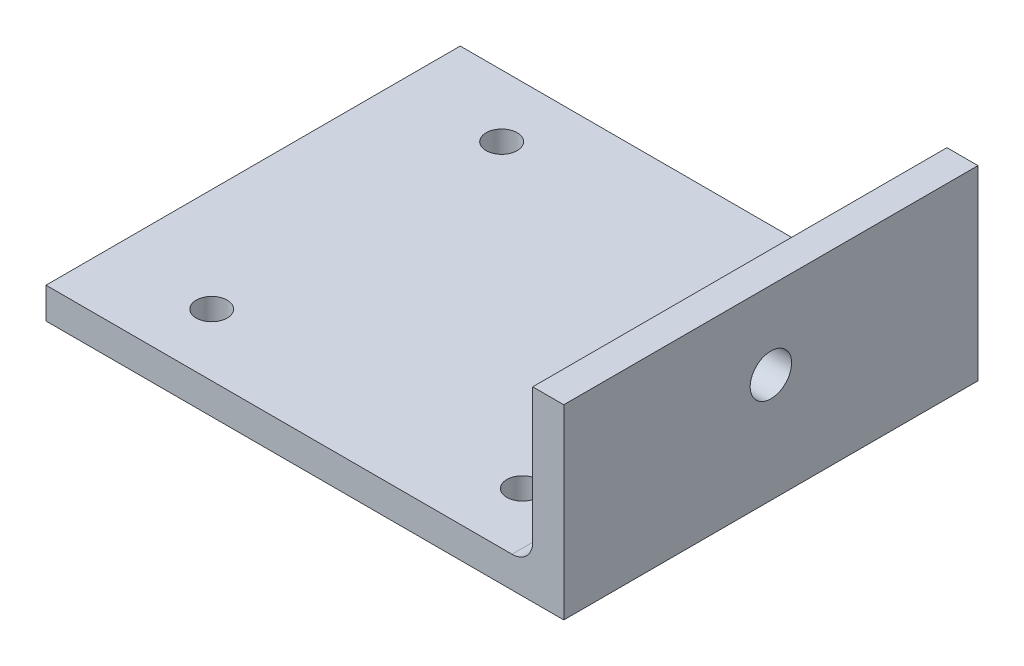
ISO-10303-21;
HEADER;
FILE_DESCRIPTION(('STEP AP214'),'2;1');
FILE_NAME('part.step','',(''),(''),'','','');
FILE_SCHEMA(('AUTOMOTIVE_DESIGN { 1 0 10303 214 1 1 1 1 }'));
ENDSEC;
DATA;
#1=APPLICATION_CONTEXT('core data for automotive mechanical design processes');
#2=APPLICATION_PROTOCOL_DEFINITION('international standard','automotive_design',2000,#1);
#3=PRODUCT_CONTEXT('',#1,'mechanical');
#4=PRODUCT('Part','Part','',(#3));
#5=PRODUCT_RELATED_PRODUCT_CATEGORY('part','',(#4));
#6=PRODUCT_DEFINITION_FORMATION('','',#4);
#7=PRODUCT_DEFINITION_CONTEXT('part definition',#1,'design');
#8=PRODUCT_DEFINITION('design','',#6,#7);
#9=PRODUCT_DEFINITION_SHAPE('','',#8);
#10=(LENGTH_UNIT() NAMED_UNIT(*) SI_UNIT(.MILLI.,.METRE.));
#11=(NAMED_UNIT(*) PLANE_ANGLE_UNIT() SI_UNIT($,.RADIAN.));
#12=(NAMED_UNIT(*) SI_UNIT($,.STERADIAN.) SOLID_ANGLE_UNIT());
#13=UNCERTAINTY_MEASURE_WITH_UNIT(LENGTH_MEASURE(1.E-05),#10,'distance_accuracy_value','');
#14=(GEOMETRIC_REPRESENTATION_CONTEXT(3) GLOBAL_UNCERTAINTY_ASSIGNED_CONTEXT((#13)) GLOBAL_UNIT_ASSIGNED_CONTEXT((#10,
#11,#12)) REPRESENTATION_CONTEXT('',''));
#15=CARTESIAN_POINT('',(0.,0.,0.));
#16=DIRECTION('',(0.,0.,1.));
#17=DIRECTION('',(1.,0.,0.));
#18=AXIS2_PLACEMENT_3D('',#15,#16,#17);
#19=CARTESIAN_POINT('',(0.,3.,0.));
#20=DIRECTION('',(0.,1.,0.));
#21=DIRECTION('',(0.,0.,1.));
#22=AXIS2_PLACEMENT_3D('',#19,#20,#21);
#23=PLANE('',#22);
#24=DIRECTION('',(1.,0.,0.));
#25=VECTOR('',#24,1.);
#26=CARTESIAN_POINT('',(-21.4432989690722,3.,22.0618556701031));
#27=LINE('',#26,#25);
#28=CARTESIAN_POINT('',(-21.4432989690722,3.,22.0618556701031));
#29=VERTEX_POINT('',#28);
#30=CARTESIAN_POINT('',(23.5567010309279,3.,22.0618556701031));
#31=VERTEX_POINT('',#30);
#32=EDGE_CURVE('E156',#29,#31,#27,.T.);
#33=ORIENTED_EDGE('',*,*,#32,.T.);
#34=DIRECTION('',(0.,0.,1.));
#35=VECTOR('',#34,1.);
#36=CARTESIAN_POINT('',(23.5567010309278,3.,0.));
#37=LINE('',#36,#35);
#38=CARTESIAN_POINT('',(23.5567010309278,3.,-17.9381443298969));
#39=VERTEX_POINT('',#38);
#40=EDGE_CURVE('E54',#31,#39,#37,.F.);
#41=ORIENTED_EDGE('',*,*,#40,.T.);
#42=DIRECTION('',(-1.,0.,0.));
#43=VECTOR('',#42,1.);
#44=CARTESIAN_POINT('',(-21.4432989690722,3.,-17.9381443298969));
#45=LINE('',#44,#43);
#46=CARTESIAN_POINT('',(-21.4432989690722,3.,-17.9381443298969));
#47=VERTEX_POINT('',#46);
#48=EDGE_CURVE('E159',#39,#47,#45,.T.);
#49=ORIENTED_EDGE('',*,*,#48,.T.);
#50=DIRECTION('',(0.,0.,1.));
#51=VECTOR('',#50,1.);
#52=CARTESIAN_POINT('',(-21.4432989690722,3.,-17.9381443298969));
#53=LINE('',#52,#51);
#54=EDGE_CURVE('E153',#47,#29,#53,.T.);
#55=ORIENTED_EDGE('',*,*,#54,.T.);
#56=EDGE_LOOP('',(#33,#41,#49,#55));
#57=FACE_BOUND('',#56,.T.);
#58=CARTESIAN_POINT('',(18.5567010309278,3.,-11.9381443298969));
#59=DIRECTION('',(0.,1.,0.));
#60=DIRECTION('',(0.,0.,1.));
#61=AXIS2_PLACEMENT_3D('',#58,#59,#60);
#62=CIRCLE('',#61,1.5);
#63=CARTESIAN_POINT('',(18.5567010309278,3.,-10.4381443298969));
#64=VERTEX_POINT('',#63);
#65=EDGE_CURVE('E135',#64,#64,#62,.T.);
#66=ORIENTED_EDGE('',*,*,#65,.F.);
#67=EDGE_LOOP('',(#66));
#68=FACE_BOUND('',#67,.T.);
#69=CARTESIAN_POINT('',(-11.4432989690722,3.,16.0618556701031));
#70=DIRECTION('',(0.,1.,0.));
#71=DIRECTION('',(0.,0.,1.));
#72=AXIS2_PLACEMENT_3D('',#69,#70,#71);
#73=CIRCLE('',#72,1.5);
#74=CARTESIAN_POINT('',(-11.4432989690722,3.,17.5618556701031));
#75=VERTEX_POINT('',#74);
#76=EDGE_CURVE('E147',#75,#75,#73,.T.);
#77=ORIENTED_EDGE('',*,*,#76,.F.);
#78=EDGE_LOOP('',(#77));
#79=FACE_BOUND('',#78,.T.);
#80=CARTESIAN_POINT('',(18.5567010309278,3.,16.0618556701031));
#81=DIRECTION('',(0.,1.,0.));
#82=DIRECTION('',(0.,0.,-1.));
#83=AXIS2_PLACEMENT_3D('',#80,#81,#82);
#84=CIRCLE('',#83,1.5);
#85=CARTESIAN_POINT('',(18.5567010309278,3.,14.5618556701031));
#86=VERTEX_POINT('',#85);
#87=EDGE_CURVE('E141',#86,#86,#84,.T.);
#88=ORIENTED_EDGE('',*,*,#87,.F.);
#89=EDGE_LOOP('',(#88));
#90=FACE_BOUND('',#89,.T.);
#91=CARTESIAN_POINT('',(-11.4432989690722,3.,-11.9381443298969));
#92=DIRECTION('',(0.,1.,0.));
#93=DIRECTION('',(0.,0.,-1.));
#94=AXIS2_PLACEMENT_3D('',#91,#92,#93);
#95=CIRCLE('',#94,1.5);
#96=CARTESIAN_POINT('',(-11.4432989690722,3.,-13.4381443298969));
#97=VERTEX_POINT('',#96);
#98=EDGE_CURVE('E129',#97,#97,#95,.T.);
#99=ORIENTED_EDGE('',*,*,#98,.F.);
#100=EDGE_LOOP('',(#99));
#101=FACE_BOUND('',#100,.T.);
#102=ADVANCED_FACE('F33',(#57,#68,#79,#90,#101),#23,.T.);
#103=CARTESIAN_POINT('',(0.,0.,0.));
#104=DIRECTION('',(0.,1.,0.));
#105=DIRECTION('',(0.,0.,1.));
#106=AXIS2_PLACEMENT_3D('',#103,#104,#105);
#107=PLANE('',#106);
#108=DIRECTION('',(0.,0.,1.));
#109=VECTOR('',#108,1.);
#110=CARTESIAN_POINT('',(-21.4432989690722,0.,-17.9381443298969));
#111=LINE('',#110,#109);
#112=CARTESIAN_POINT('',(-21.4432989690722,0.,-17.9381443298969));
#113=VERTEX_POINT('',#112);
#114=CARTESIAN_POINT('',(-21.4432989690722,0.,22.0618556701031));
#115=VERTEX_POINT('',#114);
#116=EDGE_CURVE('E150',#113,#115,#111,.T.);
#117=ORIENTED_EDGE('',*,*,#116,.F.);
#118=DIRECTION('',(-1.,0.,0.));
#119=VECTOR('',#118,1.);
#120=CARTESIAN_POINT('',(-21.4432989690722,0.,-17.9381443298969));
#121=LINE('',#120,#119);
#122=CARTESIAN_POINT('',(28.5567010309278,0.,-17.9381443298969));
#123=VERTEX_POINT('',#122);
#124=EDGE_CURVE('E157',#123,#113,#121,.T.);
#125=ORIENTED_EDGE('',*,*,#124,.F.);
#126=DIRECTION('',(0.,0.,-1.));
#127=VECTOR('',#126,1.);
#128=CARTESIAN_POINT('',(28.5567010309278,0.,-17.9381443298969));
#129=LINE('',#128,#127);
#130=CARTESIAN_POINT('',(28.5567010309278,0.,22.0618556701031));
#131=VERTEX_POINT('',#130);
#132=EDGE_CURVE('E97',#131,#123,#129,.T.);
#133=ORIENTED_EDGE('',*,*,#132,.F.);
#134=DIRECTION('',(1.,0.,0.));
#135=VECTOR('',#134,1.);
#136=CARTESIAN_POINT('',(-21.4432989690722,0.,22.0618556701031));
#137=LINE('',#136,#135);
#138=EDGE_CURVE('E163',#115,#131,#137,.T.);
#139=ORIENTED_EDGE('',*,*,#138,.F.);
#140=EDGE_LOOP('',(#117,#125,#133,#139));
#141=FACE_BOUND('',#140,.T.);
#142=CARTESIAN_POINT('',(-11.4432989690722,0.,16.0618556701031));
#143=DIRECTION('',(0.,1.,0.));
#144=DIRECTION('',(0.,0.,1.));
#145=AXIS2_PLACEMENT_3D('',#142,#143,#144);
#146=CIRCLE('',#145,1.5);
#147=CARTESIAN_POINT('',(-11.4432989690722,0.,17.5618556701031));
#148=VERTEX_POINT('',#147);
#149=EDGE_CURVE('E144',#148,#148,#146,.T.);
#150=ORIENTED_EDGE('',*,*,#149,.T.);
#151=EDGE_LOOP('',(#150));
#152=FACE_BOUND('',#151,.T.);
#153=CARTESIAN_POINT('',(18.5567010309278,0.,16.0618556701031));
#154=DIRECTION('',(0.,1.,0.));
#155=DIRECTION('',(0.,0.,-1.));
#156=AXIS2_PLACEMENT_3D('',#153,#154,#155);
#157=CIRCLE('',#156,1.5);
#158=CARTESIAN_POINT('',(18.5567010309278,0.,14.5618556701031));
#159=VERTEX_POINT('',#158);
#160=EDGE_CURVE('E138',#159,#159,#157,.T.);
#161=ORIENTED_EDGE('',*,*,#160,.T.);
#162=EDGE_LOOP('',(#161));
#163=FACE_BOUND('',#162,.T.);
#164=CARTESIAN_POINT('',(18.5567010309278,0.,-11.9381443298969));
#165=DIRECTION('',(0.,1.,0.));
#166=DIRECTION('',(0.,0.,1.));
#167=AXIS2_PLACEMENT_3D('',#164,#165,#166);
#168=CIRCLE('',#167,1.5);
#169=CARTESIAN_POINT('',(18.5567010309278,0.,-10.4381443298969));
#170=VERTEX_POINT('',#169);
#171=EDGE_CURVE('E132',#170,#170,#168,.T.);
#172=ORIENTED_EDGE('',*,*,#171,.T.);
#173=EDGE_LOOP('',(#172));
#174=FACE_BOUND('',#173,.T.);
#175=CARTESIAN_POINT('',(-11.4432989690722,0.,-11.9381443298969));
#176=DIRECTION('',(0.,1.,0.));
#177=DIRECTION('',(0.,0.,-1.));
#178=AXIS2_PLACEMENT_3D('',#175,#176,#177);
#179=CIRCLE('',#178,1.5);
#180=CARTESIAN_POINT('',(-11.4432989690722,0.,-13.4381443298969));
#181=VERTEX_POINT('',#180);
#182=EDGE_CURVE('E128',#181,#181,#179,.T.);
#183=ORIENTED_EDGE('',*,*,#182,.T.);
#184=EDGE_LOOP('',(#183));
#185=FACE_BOUND('',#184,.T.);
#186=ADVANCED_FACE('F185',(#141,#152,#163,#174,#185),#107,.F.);
#187=CARTESIAN_POINT('',(-21.4432989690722,3.,-17.9381443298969));
#188=DIRECTION('',(1.,0.,0.));
#189=DIRECTION('',(0.,0.,-1.));
#190=AXIS2_PLACEMENT_3D('',#187,#188,#189);
#191=PLANE('',#190);
#192=ORIENTED_EDGE('',*,*,#116,.T.);
#193=DIRECTION('',(0.,-1.,0.));
#194=VECTOR('',#193,1.);
#195=CARTESIAN_POINT('',(-21.4432989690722,3.,22.0618556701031));
#196=LINE('',#195,#194);
#197=EDGE_CURVE('E170',#29,#115,#196,.T.);
#198=ORIENTED_EDGE('',*,*,#197,.F.);
#199=ORIENTED_EDGE('',*,*,#54,.F.);
#200=DIRECTION('',(0.,-1.,0.));
#201=VECTOR('',#200,1.);
#202=CARTESIAN_POINT('',(-21.4432989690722,3.,-17.9381443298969));
#203=LINE('',#202,#201);
#204=EDGE_CURVE('E101',#47,#113,#203,.T.);
#205=ORIENTED_EDGE('',*,*,#204,.T.);
#206=EDGE_LOOP('',(#192,#198,#199,#205));
#207=FACE_BOUND('',#206,.T.);
#208=ADVANCED_FACE('F190',(#207),#191,.F.);
#209=CARTESIAN_POINT('',(-21.4432989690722,3.,22.0618556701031));
#210=DIRECTION('',(0.,0.,-1.));
#211=DIRECTION('',(-1.,0.,0.));
#212=AXIS2_PLACEMENT_3D('',#209,#210,#211);
#213=PLANE('',#212);
#214=ORIENTED_EDGE('',*,*,#138,.T.);
#215=DIRECTION('',(0.,-1.,0.));
#216=VECTOR('',#215,1.);
#217=CARTESIAN_POINT('',(28.5567010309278,3.,22.0618556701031));
#218=LINE('',#217,#216);
#219=CARTESIAN_POINT('',(28.5567010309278,18.,22.0618556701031));
#220=VERTEX_POINT('',#219);
#221=EDGE_CURVE('E100',#220,#131,#218,.T.);
#222=ORIENTED_EDGE('',*,*,#221,.F.);
#223=DIRECTION('',(1.,0.,0.));
#224=VECTOR('',#223,1.);
#225=CARTESIAN_POINT('',(28.5567010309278,18.,22.0618556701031));
#226=LINE('',#225,#224);
#227=CARTESIAN_POINT('',(25.5567010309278,18.,22.0618556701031));
#228=VERTEX_POINT('',#227);
#229=EDGE_CURVE('E115',#228,#220,#226,.T.);
#230=ORIENTED_EDGE('',*,*,#229,.F.);
#231=DIRECTION('',(0.,-1.,0.));
#232=VECTOR('',#231,1.);
#233=CARTESIAN_POINT('',(25.5567010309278,18.,22.0618556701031));
#234=LINE('',#233,#232);
#235=CARTESIAN_POINT('',(25.5567010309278,5.,22.0618556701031));
#236=VERTEX_POINT('',#235);
#237=EDGE_CURVE('E125',#228,#236,#234,.T.);
#238=ORIENTED_EDGE('',*,*,#237,.T.);
#239=CARTESIAN_POINT('',(23.5567010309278,5.,22.0618556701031));
#240=DIRECTION('',(0.,0.,-1.));
#241=DIRECTION('',(-1.,0.,0.));
#242=AXIS2_PLACEMENT_3D('',#239,#240,#241);
#243=CIRCLE('',#242,2.);
#244=EDGE_CURVE('E41',#236,#31,#243,.T.);
#245=ORIENTED_EDGE('',*,*,#244,.T.);
#246=ORIENTED_EDGE('',*,*,#32,.F.);
#247=ORIENTED_EDGE('',*,*,#197,.T.);
#248=EDGE_LOOP('',(#214,#222,#230,#238,#245,#246,#247));
#249=FACE_BOUND('',#248,.T.);
#250=ADVANCED_FACE('F182',(#249),#213,.F.);
#251=CARTESIAN_POINT('',(28.5567010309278,3.,-17.9381443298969));
#252=DIRECTION('',(-1.,0.,0.));
#253=DIRECTION('',(0.,0.,1.));
#254=AXIS2_PLACEMENT_3D('',#251,#252,#253);
#255=PLANE('',#254);
#256=CARTESIAN_POINT('',(28.5567010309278,10.5,2.06185567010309));
#257=DIRECTION('',(1.,0.,0.));
#258=DIRECTION('',(0.,0.,-1.));
#259=AXIS2_PLACEMENT_3D('',#256,#257,#258);
#260=CIRCLE('',#259,2.);
#261=CARTESIAN_POINT('',(28.5567010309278,10.5,0.0618556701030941));
#262=VERTEX_POINT('',#261);
#263=EDGE_CURVE('E119',#262,#262,#260,.T.);
#264=ORIENTED_EDGE('',*,*,#263,.F.);
#265=EDGE_LOOP('',(#264));
#266=FACE_BOUND('',#265,.T.);
#267=ORIENTED_EDGE('',*,*,#132,.T.);
#268=DIRECTION('',(0.,-1.,0.));
#269=VECTOR('',#268,1.);
#270=CARTESIAN_POINT('',(28.5567010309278,3.,-17.9381443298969));
#271=LINE('',#270,#269);
#272=CARTESIAN_POINT('',(28.5567010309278,18.,-17.9381443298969));
#273=VERTEX_POINT('',#272);
#274=EDGE_CURVE('E90',#273,#123,#271,.T.);
#275=ORIENTED_EDGE('',*,*,#274,.F.);
#276=DIRECTION('',(0.,0.,-1.));
#277=VECTOR('',#276,1.);
#278=CARTESIAN_POINT('',(28.5567010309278,18.,-17.9381443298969));
#279=LINE('',#278,#277);
#280=EDGE_CURVE('E95',#220,#273,#279,.T.);
#281=ORIENTED_EDGE('',*,*,#280,.F.);
#282=ORIENTED_EDGE('',*,*,#221,.T.);
#283=EDGE_LOOP('',(#267,#275,#281,#282));
#284=FACE_BOUND('',#283,.T.);
#285=ADVANCED_FACE('F92',(#266,#284),#255,.F.);
#286=CARTESIAN_POINT('',(-21.4432989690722,3.,-17.9381443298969));
#287=DIRECTION('',(0.,0.,1.));
#288=DIRECTION('',(1.,0.,0.));
#289=AXIS2_PLACEMENT_3D('',#286,#287,#288);
#290=PLANE('',#289);
#291=ORIENTED_EDGE('',*,*,#124,.T.);
#292=ORIENTED_EDGE('',*,*,#204,.F.);
#293=ORIENTED_EDGE('',*,*,#48,.F.);
#294=CARTESIAN_POINT('',(23.5567010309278,5.,-17.9381443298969));
#295=DIRECTION('',(0.,0.,1.));
#296=DIRECTION('',(1.,0.,0.));
#297=AXIS2_PLACEMENT_3D('',#294,#295,#296);
#298=CIRCLE('',#297,2.);
#299=CARTESIAN_POINT('',(25.5567010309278,5.,-17.9381443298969));
#300=VERTEX_POINT('',#299);
#301=EDGE_CURVE('E11',#39,#300,#298,.T.);
#302=ORIENTED_EDGE('',*,*,#301,.T.);
#303=DIRECTION('',(0.,-1.,0.));
#304=VECTOR('',#303,1.);
#305=CARTESIAN_POINT('',(25.5567010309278,18.,-17.9381443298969));
#306=LINE('',#305,#304);
#307=CARTESIAN_POINT('',(25.5567010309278,18.,-17.9381443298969));
#308=VERTEX_POINT('',#307);
#309=EDGE_CURVE('E107',#308,#300,#306,.T.);
#310=ORIENTED_EDGE('',*,*,#309,.F.);
#311=DIRECTION('',(-1.,0.,0.));
#312=VECTOR('',#311,1.);
#313=CARTESIAN_POINT('',(28.5567010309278,18.,-17.9381443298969));
#314=LINE('',#313,#312);
#315=EDGE_CURVE('E104',#273,#308,#314,.T.);
#316=ORIENTED_EDGE('',*,*,#315,.F.);
#317=ORIENTED_EDGE('',*,*,#274,.T.);
#318=EDGE_LOOP('',(#291,#292,#293,#302,#310,#316,#317));
#319=FACE_BOUND('',#318,.T.);
#320=ADVANCED_FACE('F105',(#319),#290,.F.);
#321=CARTESIAN_POINT('',(-11.4432989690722,3.,16.0618556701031));
#322=DIRECTION('',(0.,-1.,0.));
#323=DIRECTION('',(0.,0.,-1.));
#324=AXIS2_PLACEMENT_3D('',#321,#322,#323);
#325=CYLINDRICAL_SURFACE('',#324,1.5);
#326=ORIENTED_EDGE('',*,*,#76,.T.);
#327=EDGE_LOOP('',(#326));
#328=FACE_BOUND('',#327,.T.);
#329=ORIENTED_EDGE('',*,*,#149,.F.);
#330=EDGE_LOOP('',(#329));
#331=FACE_BOUND('',#330,.T.);
#332=ADVANCED_FACE('F207',(#328,#331),#325,.F.);
#333=CARTESIAN_POINT('',(18.5567010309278,3.,16.0618556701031));
#334=DIRECTION('',(0.,-1.,0.));
#335=DIRECTION('',(0.,0.,-1.));
#336=AXIS2_PLACEMENT_3D('',#333,#334,#335);
#337=CYLINDRICAL_SURFACE('',#336,1.5);
#338=ORIENTED_EDGE('',*,*,#87,.T.);
#339=EDGE_LOOP('',(#338));
#340=FACE_BOUND('',#339,.T.);
#341=ORIENTED_EDGE('',*,*,#160,.F.);
#342=EDGE_LOOP('',(#341));
#343=FACE_BOUND('',#342,.T.);
#344=ADVANCED_FACE('F242',(#340,#343),#337,.F.);
#345=CARTESIAN_POINT('',(18.5567010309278,3.,-11.9381443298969));
#346=DIRECTION('',(0.,-1.,0.));
#347=DIRECTION('',(0.,0.,-1.));
#348=AXIS2_PLACEMENT_3D('',#345,#346,#347);
#349=CYLINDRICAL_SURFACE('',#348,1.5);
#350=ORIENTED_EDGE('',*,*,#65,.T.);
#351=EDGE_LOOP('',(#350));
#352=FACE_BOUND('',#351,.T.);
#353=ORIENTED_EDGE('',*,*,#171,.F.);
#354=EDGE_LOOP('',(#353));
#355=FACE_BOUND('',#354,.T.);
#356=ADVANCED_FACE('F249',(#352,#355),#349,.F.);
#357=CARTESIAN_POINT('',(-11.4432989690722,3.,-11.9381443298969));
#358=DIRECTION('',(0.,-1.,0.));
#359=DIRECTION('',(0.,0.,-1.));
#360=AXIS2_PLACEMENT_3D('',#357,#358,#359);
#361=CYLINDRICAL_SURFACE('',#360,1.5);
#362=ORIENTED_EDGE('',*,*,#98,.T.);
#363=EDGE_LOOP('',(#362));
#364=FACE_BOUND('',#363,.T.);
#365=ORIENTED_EDGE('',*,*,#182,.F.);
#366=EDGE_LOOP('',(#365));
#367=FACE_BOUND('',#366,.T.);
#368=ADVANCED_FACE('F256',(#364,#367),#361,.F.);
#369=CARTESIAN_POINT('',(25.5567010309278,18.,-17.9381443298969));
#370=DIRECTION('',(1.,0.,0.));
#371=DIRECTION('',(0.,0.,-1.));
#372=AXIS2_PLACEMENT_3D('',#369,#370,#371);
#373=PLANE('',#372);
#374=CARTESIAN_POINT('',(25.5567010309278,10.5,2.06185567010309));
#375=DIRECTION('',(1.,0.,0.));
#376=DIRECTION('',(0.,0.,-1.));
#377=AXIS2_PLACEMENT_3D('',#374,#375,#376);
#378=CIRCLE('',#377,2.);
#379=CARTESIAN_POINT('',(25.5567010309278,10.5,0.0618556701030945));
#380=VERTEX_POINT('',#379);
#381=EDGE_CURVE('E116',#380,#380,#378,.F.);
#382=ORIENTED_EDGE('',*,*,#381,.F.);
#383=EDGE_LOOP('',(#382));
#384=FACE_BOUND('',#383,.T.);
#385=ORIENTED_EDGE('',*,*,#309,.T.);
#386=DIRECTION('',(0.,0.,1.));
#387=VECTOR('',#386,1.);
#388=CARTESIAN_POINT('',(25.5567010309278,5.,-17.9381443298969));
#389=LINE('',#388,#387);
#390=EDGE_CURVE('E173',#300,#236,#389,.T.);
#391=ORIENTED_EDGE('',*,*,#390,.T.);
#392=ORIENTED_EDGE('',*,*,#237,.F.);
#393=DIRECTION('',(0.,0.,1.));
#394=VECTOR('',#393,1.);
#395=CARTESIAN_POINT('',(25.5567010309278,18.,-17.9381443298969));
#396=LINE('',#395,#394);
#397=EDGE_CURVE('E110',#308,#228,#396,.T.);
#398=ORIENTED_EDGE('',*,*,#397,.F.);
#399=EDGE_LOOP('',(#385,#391,#392,#398));
#400=FACE_BOUND('',#399,.T.);
#401=ADVANCED_FACE('F179',(#384,#400),#373,.F.);
#402=CARTESIAN_POINT('',(0.,18.,0.));
#403=DIRECTION('',(0.,-1.,0.));
#404=DIRECTION('',(0.,0.,-1.));
#405=AXIS2_PLACEMENT_3D('',#402,#403,#404);
#406=PLANE('',#405);
#407=ORIENTED_EDGE('',*,*,#280,.T.);
#408=ORIENTED_EDGE('',*,*,#315,.T.);
#409=ORIENTED_EDGE('',*,*,#397,.T.);
#410=ORIENTED_EDGE('',*,*,#229,.T.);
#411=EDGE_LOOP('',(#407,#408,#409,#410));
#412=FACE_BOUND('',#411,.T.);
#413=ADVANCED_FACE('F113',(#412),#406,.F.);
#414=CARTESIAN_POINT('',(-21.4442989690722,10.5,2.0618556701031));
#415=DIRECTION('',(1.,0.,0.));
#416=DIRECTION('',(0.,0.,-1.));
#417=AXIS2_PLACEMENT_3D('',#414,#415,#416);
#418=CYLINDRICAL_SURFACE('',#417,2.);
#419=ORIENTED_EDGE('',*,*,#263,.T.);
#420=EDGE_LOOP('',(#419));
#421=FACE_BOUND('',#420,.T.);
#422=ORIENTED_EDGE('',*,*,#381,.T.);
#423=EDGE_LOOP('',(#422));
#424=FACE_BOUND('',#423,.T.);
#425=ADVANCED_FACE('F194',(#421,#424),#418,.F.);
#426=CARTESIAN_POINT('',(23.5567010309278,5.,-17.9381443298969));
#427=DIRECTION('',(0.,0.,1.));
#428=DIRECTION('',(1.,0.,0.));
#429=AXIS2_PLACEMENT_3D('',#426,#427,#428);
#430=CYLINDRICAL_SURFACE('',#429,2.);
#431=ORIENTED_EDGE('',*,*,#301,.F.);
#432=ORIENTED_EDGE('',*,*,#40,.F.);
#433=ORIENTED_EDGE('',*,*,#244,.F.);
#434=ORIENTED_EDGE('',*,*,#390,.F.);
#435=EDGE_LOOP('',(#431,#432,#433,#434));
#436=FACE_BOUND('',#435,.T.);
#437=ADVANCED_FACE('F35',(#436),#430,.F.);
#438=CLOSED_SHELL('',(#102,#186,#208,#250,#285,#320,#332,#344,#356,#368,#401,#413,#425,#437));
#439=MANIFOLD_SOLID_BREP('B2',#438);
#440=ADVANCED_BREP_SHAPE_REPRESENTATION('',(#18,#439),#14);
#441=SHAPE_DEFINITION_REPRESENTATION(#9,#440);
ENDSEC;
END-ISO-10303-21;
